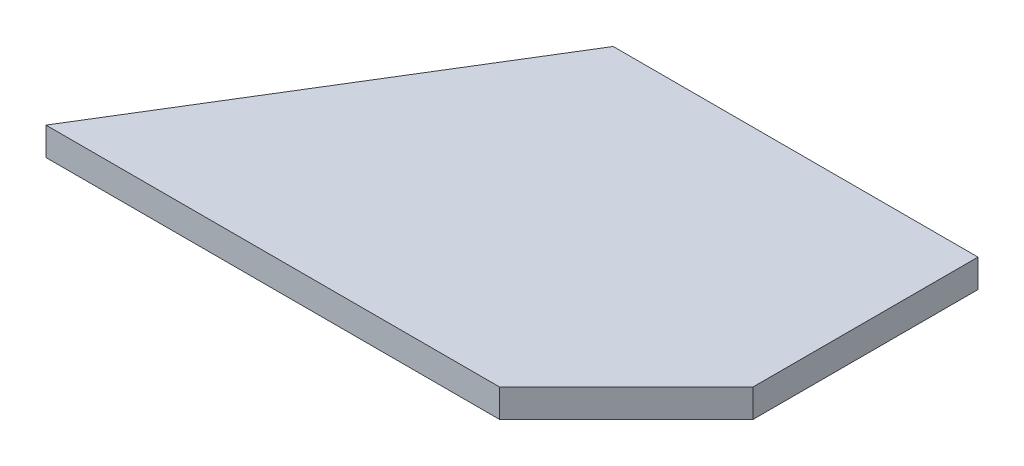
ISO-10303-21;
HEADER;
FILE_DESCRIPTION(('STEP AP214'),'2;1');
FILE_NAME('part.step','',(''),(''),'','','');
FILE_SCHEMA(('AUTOMOTIVE_DESIGN { 1 0 10303 214 1 1 1 1 }'));
ENDSEC;
DATA;
#1=APPLICATION_CONTEXT('core data for automotive mechanical design processes');
#2=APPLICATION_PROTOCOL_DEFINITION('international standard','automotive_design',2000,#1);
#3=PRODUCT_CONTEXT('',#1,'mechanical');
#4=PRODUCT('Part','Part','',(#3));
#5=PRODUCT_RELATED_PRODUCT_CATEGORY('part','',(#4));
#6=PRODUCT_DEFINITION_FORMATION('','',#4);
#7=PRODUCT_DEFINITION_CONTEXT('part definition',#1,'design');
#8=PRODUCT_DEFINITION('design','',#6,#7);
#9=PRODUCT_DEFINITION_SHAPE('','',#8);
#10=(LENGTH_UNIT() NAMED_UNIT(*) SI_UNIT(.MILLI.,.METRE.));
#11=(NAMED_UNIT(*) PLANE_ANGLE_UNIT() SI_UNIT($,.RADIAN.));
#12=(NAMED_UNIT(*) SI_UNIT($,.STERADIAN.) SOLID_ANGLE_UNIT());
#13=UNCERTAINTY_MEASURE_WITH_UNIT(LENGTH_MEASURE(1.E-05),#10,'distance_accuracy_value','');
#14=(GEOMETRIC_REPRESENTATION_CONTEXT(3) GLOBAL_UNCERTAINTY_ASSIGNED_CONTEXT((#13)) GLOBAL_UNIT_ASSIGNED_CONTEXT((#10,
#11,#12)) REPRESENTATION_CONTEXT('',''));
#15=CARTESIAN_POINT('',(0.,0.,0.));
#16=DIRECTION('',(0.,0.,1.));
#17=DIRECTION('',(1.,0.,0.));
#18=AXIS2_PLACEMENT_3D('',#15,#16,#17);
#19=CARTESIAN_POINT('',(0.,3.17500000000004,50.8));
#20=DIRECTION('',(-1.,0.,0.));
#21=DIRECTION('',(0.,0.,1.00000000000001));
#22=AXIS2_PLACEMENT_3D('',#19,#20,#21);
#23=PLANE('',#22);
#24=DIRECTION('',(0.,0.,-1.00000000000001));
#25=VECTOR('',#24,1.);
#26=CARTESIAN_POINT('',(0.,-3.17500000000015,50.8000000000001));
#27=LINE('',#26,#25);
#28=CARTESIAN_POINT('',(0.,-3.17500000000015,50.8000000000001));
#29=VERTEX_POINT('',#28);
#30=CARTESIAN_POINT('',(0.,-3.17499999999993,-2.22044604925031E-13));
#31=VERTEX_POINT('',#30);
#32=EDGE_CURVE('E106',#29,#31,#27,.T.);
#33=ORIENTED_EDGE('',*,*,#32,.T.);
#34=DIRECTION('',(0.,-1.00000000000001,0.));
#35=VECTOR('',#34,1.);
#36=CARTESIAN_POINT('',(0.,3.17500000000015,1.11022302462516E-13));
#37=LINE('',#36,#35);
#38=CARTESIAN_POINT('',(0.,3.17500000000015,1.11022302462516E-13));
#39=VERTEX_POINT('',#38);
#40=EDGE_CURVE('E11',#39,#31,#37,.T.);
#41=ORIENTED_EDGE('',*,*,#40,.F.);
#42=DIRECTION('',(0.,0.,-1.00000000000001));
#43=VECTOR('',#42,1.);
#44=CARTESIAN_POINT('',(0.,3.17500000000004,50.8));
#45=LINE('',#44,#43);
#46=CARTESIAN_POINT('',(0.,3.17500000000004,50.8));
#47=VERTEX_POINT('',#46);
#48=EDGE_CURVE('E114',#47,#39,#45,.T.);
#49=ORIENTED_EDGE('',*,*,#48,.F.);
#50=DIRECTION('',(0.,-1.00000000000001,0.));
#51=VECTOR('',#50,1.);
#52=CARTESIAN_POINT('',(0.,3.17500000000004,50.8));
#53=LINE('',#52,#51);
#54=EDGE_CURVE('E102',#47,#29,#53,.T.);
#55=ORIENTED_EDGE('',*,*,#54,.T.);
#56=EDGE_LOOP('',(#33,#41,#49,#55));
#57=FACE_BOUND('',#56,.T.);
#58=ADVANCED_FACE('F32',(#57),#23,.F.);
#59=CARTESIAN_POINT('',(0.,3.17500000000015,1.11022302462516E-13));
#60=DIRECTION('',(0.,0.,1.00000000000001));
#61=DIRECTION('',(1.,0.,0.));
#62=AXIS2_PLACEMENT_3D('',#59,#60,#61);
#63=PLANE('',#62);
#64=DIRECTION('',(-1.,0.,0.));
#65=VECTOR('',#64,1.);
#66=CARTESIAN_POINT('',(0.,-3.17499999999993,-2.22044604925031E-13));
#67=LINE('',#66,#65);
#68=CARTESIAN_POINT('',(-82.3276874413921,-3.17499999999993,-1.11022302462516E-13));
#69=VERTEX_POINT('',#68);
#70=EDGE_CURVE('E109',#31,#69,#67,.T.);
#71=ORIENTED_EDGE('',*,*,#70,.T.);
#72=DIRECTION('',(0.,-1.00000000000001,0.));
#73=VECTOR('',#72,1.);
#74=CARTESIAN_POINT('',(-82.3276874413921,3.17499999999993,-9.99200722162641E-13));
#75=LINE('',#74,#73);
#76=CARTESIAN_POINT('',(-82.3276874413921,3.17499999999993,-9.99200722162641E-13));
#77=VERTEX_POINT('',#76);
#78=EDGE_CURVE('E40',#77,#69,#75,.T.);
#79=ORIENTED_EDGE('',*,*,#78,.F.);
#80=DIRECTION('',(-1.,0.,0.));
#81=VECTOR('',#80,1.);
#82=CARTESIAN_POINT('',(0.,3.17500000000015,1.11022302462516E-13));
#83=LINE('',#82,#81);
#84=EDGE_CURVE('E82',#39,#77,#83,.T.);
#85=ORIENTED_EDGE('',*,*,#84,.F.);
#86=ORIENTED_EDGE('',*,*,#40,.T.);
#87=EDGE_LOOP('',(#71,#79,#85,#86));
#88=FACE_BOUND('',#87,.T.);
#89=ADVANCED_FACE('F133',(#88),#63,.F.);
#90=CARTESIAN_POINT('',(-82.3276874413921,3.17499999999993,-9.99200722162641E-13));
#91=DIRECTION('',(0.85264016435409,0.,0.522498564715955));
#92=DIRECTION('',(0.522498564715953,0.,-0.85264016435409));
#93=AXIS2_PLACEMENT_3D('',#90,#91,#92);
#94=PLANE('',#93);
#95=DIRECTION('',(-0.522498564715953,0.,0.852640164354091));
#96=VECTOR('',#95,1.);
#97=CARTESIAN_POINT('',(-82.3276874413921,-3.17499999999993,-1.11022302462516E-13));
#98=LINE('',#97,#96);
#99=CARTESIAN_POINT('',(-130.968750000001,-3.17500000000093,79.3749999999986));
#100=VERTEX_POINT('',#99);
#101=EDGE_CURVE('E97',#69,#100,#98,.T.);
#102=ORIENTED_EDGE('',*,*,#101,.T.);
#103=DIRECTION('',(0.,-1.00000000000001,0.));
#104=VECTOR('',#103,1.);
#105=CARTESIAN_POINT('',(-130.968750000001,3.17499999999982,79.3749999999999));
#106=LINE('',#105,#104);
#107=CARTESIAN_POINT('',(-130.968750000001,3.17499999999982,79.3749999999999));
#108=VERTEX_POINT('',#107);
#109=EDGE_CURVE('E94',#108,#100,#106,.T.);
#110=ORIENTED_EDGE('',*,*,#109,.F.);
#111=DIRECTION('',(-0.522498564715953,0.,0.852640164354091));
#112=VECTOR('',#111,1.);
#113=CARTESIAN_POINT('',(-82.3276874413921,3.17499999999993,-9.99200722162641E-13));
#114=LINE('',#113,#112);
#115=EDGE_CURVE('E86',#77,#108,#114,.T.);
#116=ORIENTED_EDGE('',*,*,#115,.F.);
#117=ORIENTED_EDGE('',*,*,#78,.T.);
#118=EDGE_LOOP('',(#102,#110,#116,#117));
#119=FACE_BOUND('',#118,.T.);
#120=ADVANCED_FACE('F95',(#119),#94,.F.);
#121=CARTESIAN_POINT('',(-130.968750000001,3.17499999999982,79.3749999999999));
#122=DIRECTION('',(0.,0.,-1.00000000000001));
#123=DIRECTION('',(-1.,0.,0.));
#124=AXIS2_PLACEMENT_3D('',#121,#122,#123);
#125=PLANE('',#124);
#126=DIRECTION('',(1.,0.,0.));
#127=VECTOR('',#126,1.);
#128=CARTESIAN_POINT('',(-130.968750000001,-3.17500000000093,79.3749999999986));
#129=LINE('',#128,#127);
#130=CARTESIAN_POINT('',(-28.575,-3.17499999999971,79.3750000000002));
#131=VERTEX_POINT('',#130);
#132=EDGE_CURVE('E68',#100,#131,#129,.T.);
#133=ORIENTED_EDGE('',*,*,#132,.T.);
#134=DIRECTION('',(0.,-1.00000000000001,0.));
#135=VECTOR('',#134,1.);
#136=CARTESIAN_POINT('',(-28.575,3.17500000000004,79.3750000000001));
#137=LINE('',#136,#135);
#138=CARTESIAN_POINT('',(-28.575,3.17500000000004,79.3750000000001));
#139=VERTEX_POINT('',#138);
#140=EDGE_CURVE('E98',#139,#131,#137,.T.);
#141=ORIENTED_EDGE('',*,*,#140,.F.);
#142=DIRECTION('',(1.,0.,0.));
#143=VECTOR('',#142,1.);
#144=CARTESIAN_POINT('',(-130.968750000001,3.17499999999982,79.3749999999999));
#145=LINE('',#144,#143);
#146=EDGE_CURVE('E90',#108,#139,#145,.T.);
#147=ORIENTED_EDGE('',*,*,#146,.F.);
#148=ORIENTED_EDGE('',*,*,#109,.T.);
#149=EDGE_LOOP('',(#133,#141,#147,#148));
#150=FACE_BOUND('',#149,.T.);
#151=ADVANCED_FACE('F100',(#150),#125,.F.);
#152=CARTESIAN_POINT('',(-28.575,3.17500000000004,79.3750000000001));
#153=DIRECTION('',(-0.707106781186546,0.,-0.707106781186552));
#154=DIRECTION('',(-0.707106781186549,0.,0.707106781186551));
#155=AXIS2_PLACEMENT_3D('',#152,#153,#154);
#156=PLANE('',#155);
#157=DIRECTION('',(0.707106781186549,0.,-0.707106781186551));
#158=VECTOR('',#157,1.);
#159=CARTESIAN_POINT('',(-28.575,-3.17499999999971,79.3750000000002));
#160=LINE('',#159,#158);
#161=EDGE_CURVE('E74',#131,#29,#160,.T.);
#162=ORIENTED_EDGE('',*,*,#161,.T.);
#163=ORIENTED_EDGE('',*,*,#54,.F.);
#164=DIRECTION('',(0.707106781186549,0.,-0.707106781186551));
#165=VECTOR('',#164,1.);
#166=CARTESIAN_POINT('',(-28.575,3.17500000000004,79.3750000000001));
#167=LINE('',#166,#165);
#168=EDGE_CURVE('E48',#139,#47,#167,.T.);
#169=ORIENTED_EDGE('',*,*,#168,.F.);
#170=ORIENTED_EDGE('',*,*,#140,.T.);
#171=EDGE_LOOP('',(#162,#163,#169,#170));
#172=FACE_BOUND('',#171,.T.);
#173=ADVANCED_FACE('F122',(#172),#156,.F.);
#174=CARTESIAN_POINT('',(0.,3.17500000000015,1.11022302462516E-13));
#175=DIRECTION('',(0.,1.00000000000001,0.));
#176=DIRECTION('',(0.,0.,1.00000000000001));
#177=AXIS2_PLACEMENT_3D('',#174,#175,#176);
#178=PLANE('',#177);
#179=ORIENTED_EDGE('',*,*,#48,.T.);
#180=ORIENTED_EDGE('',*,*,#84,.T.);
#181=ORIENTED_EDGE('',*,*,#115,.T.);
#182=ORIENTED_EDGE('',*,*,#146,.T.);
#183=ORIENTED_EDGE('',*,*,#168,.T.);
#184=EDGE_LOOP('',(#179,#180,#181,#182,#183));
#185=FACE_BOUND('',#184,.T.);
#186=ADVANCED_FACE('F88',(#185),#178,.T.);
#187=CARTESIAN_POINT('',(0.,-3.17499999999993,-2.22044604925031E-13));
#188=DIRECTION('',(0.,1.00000000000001,0.));
#189=DIRECTION('',(0.,0.,1.00000000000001));
#190=AXIS2_PLACEMENT_3D('',#187,#188,#189);
#191=PLANE('',#190);
#192=ORIENTED_EDGE('',*,*,#32,.F.);
#193=ORIENTED_EDGE('',*,*,#161,.F.);
#194=ORIENTED_EDGE('',*,*,#132,.F.);
#195=ORIENTED_EDGE('',*,*,#101,.F.);
#196=ORIENTED_EDGE('',*,*,#70,.F.);
#197=EDGE_LOOP('',(#192,#193,#194,#195,#196));
#198=FACE_BOUND('',#197,.T.);
#199=ADVANCED_FACE('F118',(#198),#191,.F.);
#200=CLOSED_SHELL('',(#58,#89,#120,#151,#173,#186,#199));
#201=MANIFOLD_SOLID_BREP('B2',#200);
#202=ADVANCED_BREP_SHAPE_REPRESENTATION('',(#18,#201),#14);
#203=SHAPE_DEFINITION_REPRESENTATION(#9,#202);
ENDSEC;
END-ISO-10303-21;
